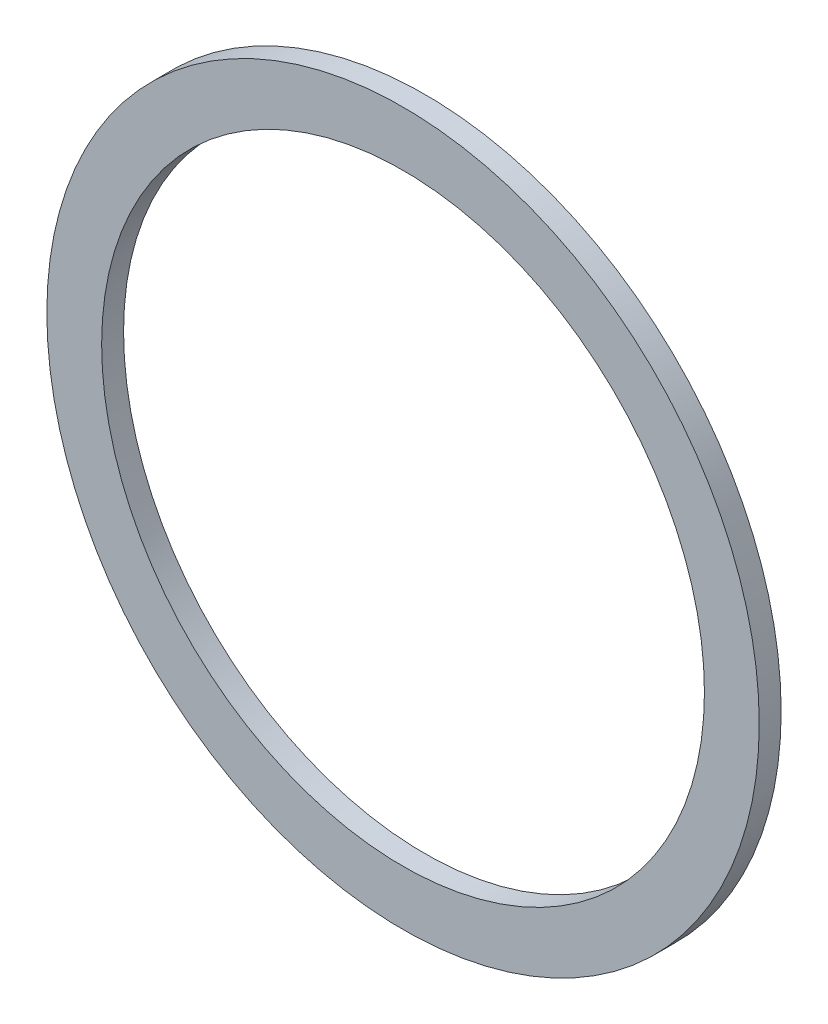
ISO-10303-21;
HEADER;
FILE_DESCRIPTION(('STEP AP214'),'2;1');
FILE_NAME('part.step','',(''),(''),'','','');
FILE_SCHEMA(('AUTOMOTIVE_DESIGN { 1 0 10303 214 1 1 1 1 }'));
ENDSEC;
DATA;
#1=APPLICATION_CONTEXT('core data for automotive mechanical design processes');
#2=APPLICATION_PROTOCOL_DEFINITION('international standard','automotive_design',2000,#1);
#3=PRODUCT_CONTEXT('',#1,'mechanical');
#4=PRODUCT('Part','Part','',(#3));
#5=PRODUCT_RELATED_PRODUCT_CATEGORY('part','',(#4));
#6=PRODUCT_DEFINITION_FORMATION('','',#4);
#7=PRODUCT_DEFINITION_CONTEXT('part definition',#1,'design');
#8=PRODUCT_DEFINITION('design','',#6,#7);
#9=PRODUCT_DEFINITION_SHAPE('','',#8);
#10=(LENGTH_UNIT() NAMED_UNIT(*) SI_UNIT(.MILLI.,.METRE.));
#11=(NAMED_UNIT(*) PLANE_ANGLE_UNIT() SI_UNIT($,.RADIAN.));
#12=(NAMED_UNIT(*) SI_UNIT($,.STERADIAN.) SOLID_ANGLE_UNIT());
#13=UNCERTAINTY_MEASURE_WITH_UNIT(LENGTH_MEASURE(1.E-05),#10,'distance_accuracy_value','');
#14=(GEOMETRIC_REPRESENTATION_CONTEXT(3) GLOBAL_UNCERTAINTY_ASSIGNED_CONTEXT((#13)) GLOBAL_UNIT_ASSIGNED_CONTEXT((#10,
#11,#12)) REPRESENTATION_CONTEXT('',''));
#15=CARTESIAN_POINT('',(0.,0.,0.));
#16=DIRECTION('',(0.,0.,1.));
#17=DIRECTION('',(1.,0.,0.));
#18=AXIS2_PLACEMENT_3D('',#15,#16,#17);
#19=CARTESIAN_POINT('',(0.,0.,0.));
#20=DIRECTION('',(0.,0.,1.));
#21=DIRECTION('',(1.,0.,0.));
#22=AXIS2_PLACEMENT_3D('',#19,#20,#21);
#23=CYLINDRICAL_SURFACE('',#22,55.);
#24=CARTESIAN_POINT('',(0.,0.,0.));
#25=DIRECTION('',(0.,0.,-1.));
#26=DIRECTION('',(-1.,0.,0.));
#27=AXIS2_PLACEMENT_3D('',#24,#25,#26);
#28=CIRCLE('',#27,55.);
#29=CARTESIAN_POINT('',(55.,0.,0.));
#30=VERTEX_POINT('',#29);
#31=EDGE_CURVE('E9',#30,#30,#28,.T.);
#32=ORIENTED_EDGE('',*,*,#31,.T.);
#33=DIRECTION('',(0.,0.,1.));
#34=VECTOR('',#33,1.);
#35=CARTESIAN_POINT('',(55.,0.,2.));
#36=LINE('',#35,#34);
#37=CARTESIAN_POINT('',(55.,0.,4.));
#38=VERTEX_POINT('',#37);
#39=EDGE_CURVE('E24',#30,#38,#36,.T.);
#40=ORIENTED_EDGE('',*,*,#39,.T.);
#41=CARTESIAN_POINT('',(0.,0.,4.));
#42=DIRECTION('',(0.,0.,1.));
#43=DIRECTION('',(1.,0.,0.));
#44=AXIS2_PLACEMENT_3D('',#41,#42,#43);
#45=CIRCLE('',#44,55.);
#46=EDGE_CURVE('E48',#38,#38,#45,.T.);
#47=ORIENTED_EDGE('',*,*,#46,.T.);
#48=ORIENTED_EDGE('',*,*,#39,.F.);
#49=EDGE_LOOP('',(#32,#40,#47,#48));
#50=FACE_BOUND('',#49,.T.);
#51=ADVANCED_FACE('F14',(#50),#23,.F.);
#52=CARTESIAN_POINT('',(0.,0.,0.));
#53=DIRECTION('',(0.,0.,1.));
#54=DIRECTION('',(1.,0.,0.));
#55=AXIS2_PLACEMENT_3D('',#52,#53,#54);
#56=CYLINDRICAL_SURFACE('',#55,65.);
#57=CARTESIAN_POINT('',(0.,0.,0.));
#58=DIRECTION('',(0.,0.,1.));
#59=DIRECTION('',(1.,0.,0.));
#60=AXIS2_PLACEMENT_3D('',#57,#58,#59);
#61=CIRCLE('',#60,65.);
#62=CARTESIAN_POINT('',(65.,0.,0.));
#63=VERTEX_POINT('',#62);
#64=EDGE_CURVE('E39',#63,#63,#61,.T.);
#65=ORIENTED_EDGE('',*,*,#64,.T.);
#66=DIRECTION('',(0.,0.,-1.));
#67=VECTOR('',#66,1.);
#68=CARTESIAN_POINT('',(65.,0.,2.));
#69=LINE('',#68,#67);
#70=CARTESIAN_POINT('',(65.,0.,4.));
#71=VERTEX_POINT('',#70);
#72=EDGE_CURVE('E18',#71,#63,#69,.T.);
#73=ORIENTED_EDGE('',*,*,#72,.F.);
#74=CARTESIAN_POINT('',(0.,0.,4.));
#75=DIRECTION('',(0.,0.,-1.));
#76=DIRECTION('',(-1.,0.,0.));
#77=AXIS2_PLACEMENT_3D('',#74,#75,#76);
#78=CIRCLE('',#77,65.);
#79=EDGE_CURVE('E43',#71,#71,#78,.T.);
#80=ORIENTED_EDGE('',*,*,#79,.T.);
#81=ORIENTED_EDGE('',*,*,#72,.T.);
#82=EDGE_LOOP('',(#65,#73,#80,#81));
#83=FACE_BOUND('',#82,.T.);
#84=ADVANCED_FACE('F58',(#83),#56,.T.);
#85=CARTESIAN_POINT('',(68.2499930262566,-68.2499930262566,4.));
#86=DIRECTION('',(0.,0.,1.));
#87=DIRECTION('',(0.,1.,0.));
#88=AXIS2_PLACEMENT_3D('',#85,#86,#87);
#89=PLANE('',#88);
#90=ORIENTED_EDGE('',*,*,#46,.F.);
#91=EDGE_LOOP('',(#90));
#92=FACE_BOUND('',#91,.T.);
#93=ORIENTED_EDGE('',*,*,#79,.F.);
#94=EDGE_LOOP('',(#93));
#95=FACE_BOUND('',#94,.T.);
#96=ADVANCED_FACE('F44',(#92,#95),#89,.T.);
#97=CARTESIAN_POINT('',(-68.2499930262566,68.2499930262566,0.));
#98=DIRECTION('',(0.,0.,-1.));
#99=DIRECTION('',(1.,0.,0.));
#100=AXIS2_PLACEMENT_3D('',#97,#98,#99);
#101=PLANE('',#100);
#102=ORIENTED_EDGE('',*,*,#31,.F.);
#103=EDGE_LOOP('',(#102));
#104=FACE_BOUND('',#103,.T.);
#105=ORIENTED_EDGE('',*,*,#64,.F.);
#106=EDGE_LOOP('',(#105));
#107=FACE_BOUND('',#106,.T.);
#108=ADVANCED_FACE('F16',(#104,#107),#101,.T.);
#109=CLOSED_SHELL('',(#51,#84,#96,#108));
#110=MANIFOLD_SOLID_BREP('B1',#109);
#111=ADVANCED_BREP_SHAPE_REPRESENTATION('',(#18,#110),#14);
#112=SHAPE_DEFINITION_REPRESENTATION(#9,#111);
ENDSEC;
END-ISO-10303-21;
